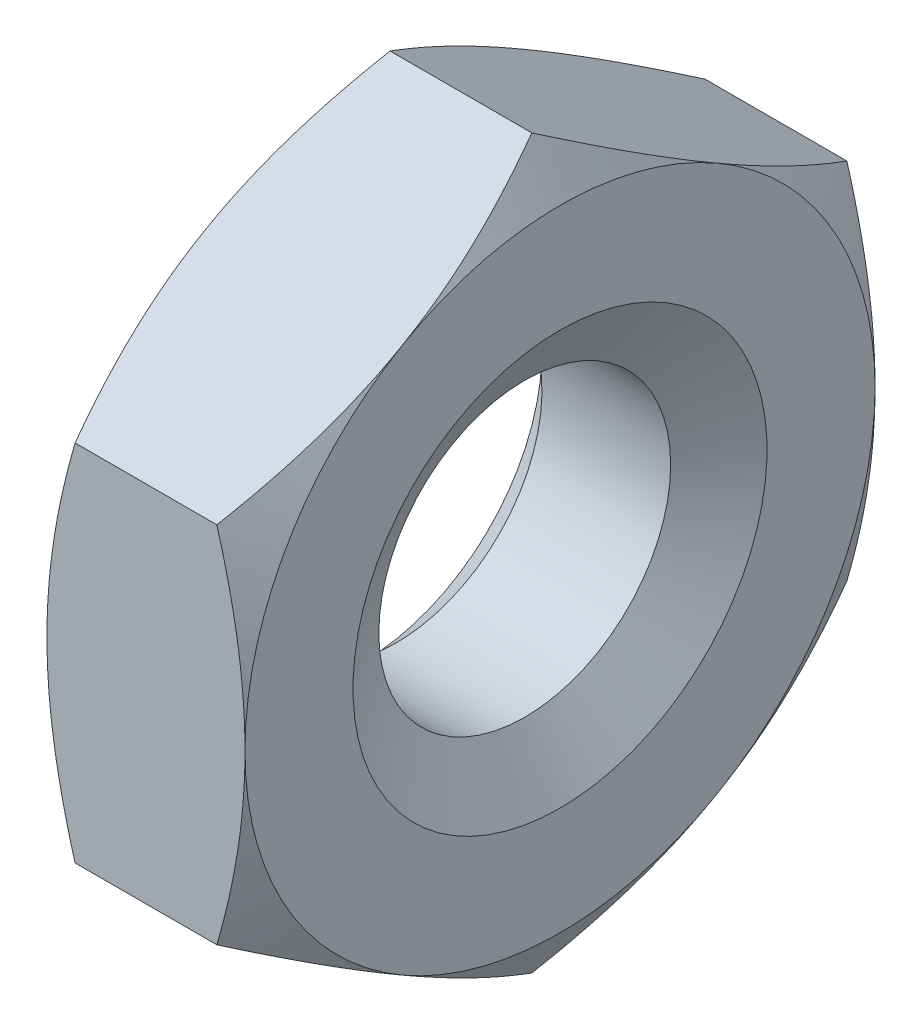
ISO-10303-21;
HEADER;
FILE_DESCRIPTION(('STEP AP214'),'2;1');
FILE_NAME('part.step','',(''),(''),'','','');
FILE_SCHEMA(('AUTOMOTIVE_DESIGN { 1 0 10303 214 1 1 1 1 }'));
ENDSEC;
DATA;
#1=APPLICATION_CONTEXT('core data for automotive mechanical design processes');
#2=APPLICATION_PROTOCOL_DEFINITION('international standard','automotive_design',2000,#1);
#3=PRODUCT_CONTEXT('',#1,'mechanical');
#4=PRODUCT('Part','Part','',(#3));
#5=PRODUCT_RELATED_PRODUCT_CATEGORY('part','',(#4));
#6=PRODUCT_DEFINITION_FORMATION('','',#4);
#7=PRODUCT_DEFINITION_CONTEXT('part definition',#1,'design');
#8=PRODUCT_DEFINITION('design','',#6,#7);
#9=PRODUCT_DEFINITION_SHAPE('','',#8);
#10=(LENGTH_UNIT() NAMED_UNIT(*) SI_UNIT(.MILLI.,.METRE.));
#11=(NAMED_UNIT(*) PLANE_ANGLE_UNIT() SI_UNIT($,.RADIAN.));
#12=(NAMED_UNIT(*) SI_UNIT($,.STERADIAN.) SOLID_ANGLE_UNIT());
#13=UNCERTAINTY_MEASURE_WITH_UNIT(LENGTH_MEASURE(1.E-05),#10,'distance_accuracy_value','');
#14=(GEOMETRIC_REPRESENTATION_CONTEXT(3) GLOBAL_UNCERTAINTY_ASSIGNED_CONTEXT((#13)) GLOBAL_UNIT_ASSIGNED_CONTEXT((#10,
#11,#12)) REPRESENTATION_CONTEXT('',''));
#15=CARTESIAN_POINT('',(0.,0.,0.));
#16=DIRECTION('',(0.,0.,1.));
#17=DIRECTION('',(1.,0.,0.));
#18=AXIS2_PLACEMENT_3D('',#15,#16,#17);
#19=CARTESIAN_POINT('',(1.53604719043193,0.,0.));
#20=DIRECTION('',(1.,0.,0.));
#21=DIRECTION('',(0.,1.,0.));
#22=AXIS2_PLACEMENT_3D('',#19,#20,#21);
#23=CONICAL_SURFACE('',#22,1.15,1.0471975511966);
#24=CARTESIAN_POINT('',(1.8080513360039,0.,0.));
#25=DIRECTION('',(1.,0.,0.));
#26=DIRECTION('',(0.,1.,0.));
#27=AXIS2_PLACEMENT_3D('',#24,#25,#26);
#28=CIRCLE('',#27,1.621125);
#29=CARTESIAN_POINT('',(1.8080513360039,-1.621125,0.));
#30=VERTEX_POINT('',#29);
#31=EDGE_CURVE('E27',#30,#30,#28,.T.);
#32=ORIENTED_EDGE('',*,*,#31,.F.);
#33=EDGE_LOOP('',(#32));
#34=FACE_BOUND('',#33,.T.);
#35=CARTESIAN_POINT('',(2.2,0.,0.));
#36=DIRECTION('',(-1.,0.,0.));
#37=DIRECTION('',(0.,0.,-1.));
#38=AXIS2_PLACEMENT_3D('',#35,#36,#37);
#39=CIRCLE('',#38,2.3);
#40=CARTESIAN_POINT('',(2.2,2.3,0.));
#41=VERTEX_POINT('',#40);
#42=EDGE_CURVE('E178',#41,#41,#39,.T.);
#43=ORIENTED_EDGE('',*,*,#42,.F.);
#44=EDGE_LOOP('',(#43));
#45=FACE_BOUND('',#44,.T.);
#46=ADVANCED_FACE('F15',(#34,#45),#23,.F.);
#47=CARTESIAN_POINT('',(0.1894375,0.,0.));
#48=DIRECTION('',(-1.,0.,0.));
#49=DIRECTION('',(0.,1.,0.));
#50=AXIS2_PLACEMENT_3D('',#47,#48,#49);
#51=CONICAL_SURFACE('',#50,1.8105625,0.785398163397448);
#52=CARTESIAN_POINT('',(0.378875,0.,0.));
#53=DIRECTION('',(1.,0.,0.));
#54=DIRECTION('',(0.,1.,0.));
#55=AXIS2_PLACEMENT_3D('',#52,#53,#54);
#56=CIRCLE('',#55,1.621125);
#57=CARTESIAN_POINT('',(0.378875,1.621125,0.));
#58=VERTEX_POINT('',#57);
#59=EDGE_CURVE('E9',#58,#58,#56,.T.);
#60=ORIENTED_EDGE('',*,*,#59,.T.);
#61=EDGE_LOOP('',(#60));
#62=FACE_BOUND('',#61,.T.);
#63=CARTESIAN_POINT('',(0.,0.,0.));
#64=DIRECTION('',(1.,0.,0.));
#65=DIRECTION('',(0.,1.,0.));
#66=AXIS2_PLACEMENT_3D('',#63,#64,#65);
#67=CIRCLE('',#66,2.);
#68=CARTESIAN_POINT('',(0.,2.,0.));
#69=VERTEX_POINT('',#68);
#70=EDGE_CURVE('E167',#69,#69,#67,.T.);
#71=ORIENTED_EDGE('',*,*,#70,.F.);
#72=EDGE_LOOP('',(#71));
#73=FACE_BOUND('',#72,.T.);
#74=ADVANCED_FACE('F398',(#62,#73),#51,.F.);
#75=CARTESIAN_POINT('',(1.7894375,0.,0.));
#76=DIRECTION('',(-1.,0.,0.));
#77=DIRECTION('',(0.,1.,0.));
#78=AXIS2_PLACEMENT_3D('',#75,#76,#77);
#79=CYLINDRICAL_SURFACE('',#78,1.621125);
#80=ORIENTED_EDGE('',*,*,#31,.T.);
#81=EDGE_LOOP('',(#80));
#82=FACE_BOUND('',#81,.T.);
#83=ORIENTED_EDGE('',*,*,#59,.F.);
#84=EDGE_LOOP('',(#83));
#85=FACE_BOUND('',#84,.T.);
#86=ADVANCED_FACE('F389',(#82,#85),#79,.F.);
#87=CARTESIAN_POINT('',(0.156606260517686,0.,0.));
#88=DIRECTION('',(1.,0.,0.));
#89=DIRECTION('',(0.,-1.,0.));
#90=AXIS2_PLACEMENT_3D('',#87,#88,#89);
#91=CONICAL_SURFACE('',#90,3.77125,1.0471975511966);
#92=CARTESIAN_POINT('',(0.313212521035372,-2.02282135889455,3.5));
#93=CARTESIAN_POINT('',(0.,-0.938664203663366,3.5));
#94=CARTESIAN_POINT('',(0.,0.,3.5));
#95=CARTESIAN_POINT('',(0.,0.938664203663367,3.5));
#96=CARTESIAN_POINT('',(0.313212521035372,2.02282135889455,3.5));
#97=(BOUNDED_CURVE() B_SPLINE_CURVE(2,(#92,#93,#94,#95,#96),.UNSPECIFIED.,.F.,
.F.) B_SPLINE_CURVE_WITH_KNOTS((3,2,3),(0.,2.05216073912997,4.10432147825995),
.UNSPECIFIED.) CURVE() GEOMETRIC_REPRESENTATION_ITEM() RATIONAL_B_SPLINE_CURVE((1.,
1.03802697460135,1.,1.03802697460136,1.)) REPRESENTATION_ITEM(''));
#98=CARTESIAN_POINT('',(0.312607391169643,-2.02072594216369,3.5));
#99=VERTEX_POINT('',#98);
#100=CARTESIAN_POINT('',(0.,0.,3.5));
#101=VERTEX_POINT('',#100);
#102=EDGE_CURVE('E242',#99,#101,#97,.T.);
#103=ORIENTED_EDGE('',*,*,#102,.T.);
#104=CARTESIAN_POINT('',(0.,0.,0.));
#105=DIRECTION('',(1.,0.,0.));
#106=DIRECTION('',(0.,-1.,0.));
#107=AXIS2_PLACEMENT_3D('',#104,#105,#106);
#108=CIRCLE('',#107,3.5);
#109=CARTESIAN_POINT('',(0.,-3.03108891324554,1.75));
#110=VERTEX_POINT('',#109);
#111=EDGE_CURVE('E223',#101,#110,#108,.T.);
#112=ORIENTED_EDGE('',*,*,#111,.T.);
#113=CARTESIAN_POINT('',(0.313212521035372,-4.04249959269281,-0.00181468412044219));
#114=CARTESIAN_POINT('',(0.,-3.50042101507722,0.937092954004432));
#115=CARTESIAN_POINT('',(0.,-3.03108891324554,1.75));
#116=CARTESIAN_POINT('',(0.,-2.56175681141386,2.56290704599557));
#117=CARTESIAN_POINT('',(0.313212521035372,-2.01967823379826,3.50181468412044));
#118=(BOUNDED_CURVE() B_SPLINE_CURVE(2,(#113,#114,#115,#116,#117),.UNSPECIFIED.,.F.,
.F.) B_SPLINE_CURVE_WITH_KNOTS((3,2,3),(0.,2.05216073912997,4.10432147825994),
.UNSPECIFIED.) CURVE() GEOMETRIC_REPRESENTATION_ITEM() RATIONAL_B_SPLINE_CURVE((1.,
1.03802697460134,1.,1.03802697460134,1.)) REPRESENTATION_ITEM(''));
#119=EDGE_CURVE('E119',#110,#99,#118,.T.);
#120=ORIENTED_EDGE('',*,*,#119,.T.);
#121=EDGE_LOOP('',(#103,#112,#120));
#122=FACE_BOUND('',#121,.T.);
#123=ADVANCED_FACE('F387',(#122),#91,.T.);
#124=CARTESIAN_POINT('',(0.156606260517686,0.,0.));
#125=DIRECTION('',(1.,0.,0.));
#126=DIRECTION('',(0.,-1.,0.));
#127=AXIS2_PLACEMENT_3D('',#124,#125,#126);
#128=CONICAL_SURFACE('',#127,3.77125,1.0471975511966);
#129=CARTESIAN_POINT('',(0.313212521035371,2.01967823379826,3.50181468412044));
#130=CARTESIAN_POINT('',(0.,2.56175681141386,2.56290704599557));
#131=CARTESIAN_POINT('',(0.,3.03108891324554,1.75));
#132=CARTESIAN_POINT('',(0.,3.50042101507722,0.937092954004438));
#133=CARTESIAN_POINT('',(0.313212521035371,4.04249959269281,-0.00181468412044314));
#134=(BOUNDED_CURVE() B_SPLINE_CURVE(2,(#129,#130,#131,#132,#133),.UNSPECIFIED.,.F.,
.F.) B_SPLINE_CURVE_WITH_KNOTS((3,2,3),(0.,2.05216073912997,4.10432147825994),
.UNSPECIFIED.) CURVE() GEOMETRIC_REPRESENTATION_ITEM() RATIONAL_B_SPLINE_CURVE((1.,
1.03802697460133,1.,1.03802697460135,1.)) REPRESENTATION_ITEM(''));
#135=CARTESIAN_POINT('',(0.312607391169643,2.02072594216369,3.5));
#136=VERTEX_POINT('',#135);
#137=CARTESIAN_POINT('',(0.,3.03108891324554,1.75));
#138=VERTEX_POINT('',#137);
#139=EDGE_CURVE('E224',#136,#138,#134,.T.);
#140=ORIENTED_EDGE('',*,*,#139,.T.);
#141=CARTESIAN_POINT('',(0.,0.,0.));
#142=DIRECTION('',(1.,0.,0.));
#143=DIRECTION('',(0.,-1.,0.));
#144=AXIS2_PLACEMENT_3D('',#141,#142,#143);
#145=CIRCLE('',#144,3.5);
#146=EDGE_CURVE('E186',#138,#101,#145,.T.);
#147=ORIENTED_EDGE('',*,*,#146,.T.);
#148=CARTESIAN_POINT('',(0.313212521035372,-2.02282135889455,3.5));
#149=CARTESIAN_POINT('',(0.,-0.938664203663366,3.5));
#150=CARTESIAN_POINT('',(0.,0.,3.5));
#151=CARTESIAN_POINT('',(0.,0.938664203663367,3.5));
#152=CARTESIAN_POINT('',(0.313212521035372,2.02282135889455,3.5));
#153=(BOUNDED_CURVE() B_SPLINE_CURVE(2,(#148,#149,#150,#151,#152),.UNSPECIFIED.,.F.,
.F.) B_SPLINE_CURVE_WITH_KNOTS((3,2,3),(0.,2.05216073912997,4.10432147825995),
.UNSPECIFIED.) CURVE() GEOMETRIC_REPRESENTATION_ITEM() RATIONAL_B_SPLINE_CURVE((1.,
1.03802697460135,1.,1.03802697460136,1.)) REPRESENTATION_ITEM(''));
#154=EDGE_CURVE('E182',#101,#136,#153,.T.);
#155=ORIENTED_EDGE('',*,*,#154,.T.);
#156=EDGE_LOOP('',(#140,#147,#155));
#157=FACE_BOUND('',#156,.T.);
#158=ADVANCED_FACE('F380',(#157),#128,.T.);
#159=CARTESIAN_POINT('',(0.156606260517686,0.,0.));
#160=DIRECTION('',(1.,0.,0.));
#161=DIRECTION('',(0.,-1.,0.));
#162=AXIS2_PLACEMENT_3D('',#159,#160,#161);
#163=CONICAL_SURFACE('',#162,3.77125,1.0471975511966);
#164=CARTESIAN_POINT('',(0.313212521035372,4.04249959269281,0.00181468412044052));
#165=CARTESIAN_POINT('',(0.,3.50042101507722,-0.937092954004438));
#166=CARTESIAN_POINT('',(0.,3.03108891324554,-1.75));
#167=CARTESIAN_POINT('',(0.,2.56175681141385,-2.56290704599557));
#168=CARTESIAN_POINT('',(0.313212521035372,2.01967823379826,-3.50181468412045));
#169=(BOUNDED_CURVE() B_SPLINE_CURVE(2,(#164,#165,#166,#167,#168),.UNSPECIFIED.,.F.,
.F.) B_SPLINE_CURVE_WITH_KNOTS((3,2,3),(0.,2.05216073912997,4.10432147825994),
.UNSPECIFIED.) CURVE() GEOMETRIC_REPRESENTATION_ITEM() RATIONAL_B_SPLINE_CURVE((1.,
1.03802697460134,1.,1.03802697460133,1.)) REPRESENTATION_ITEM(''));
#170=CARTESIAN_POINT('',(0.312607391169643,4.04145188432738,0.));
#171=VERTEX_POINT('',#170);
#172=CARTESIAN_POINT('',(0.,3.03108891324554,-1.75));
#173=VERTEX_POINT('',#172);
#174=EDGE_CURVE('E174',#171,#173,#169,.T.);
#175=ORIENTED_EDGE('',*,*,#174,.T.);
#176=CARTESIAN_POINT('',(0.,0.,0.));
#177=DIRECTION('',(1.,0.,0.));
#178=DIRECTION('',(0.,-1.,0.));
#179=AXIS2_PLACEMENT_3D('',#176,#177,#178);
#180=CIRCLE('',#179,3.5);
#181=EDGE_CURVE('E187',#173,#138,#180,.T.);
#182=ORIENTED_EDGE('',*,*,#181,.T.);
#183=CARTESIAN_POINT('',(0.313212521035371,2.01967823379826,3.50181468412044));
#184=CARTESIAN_POINT('',(0.,2.56175681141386,2.56290704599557));
#185=CARTESIAN_POINT('',(0.,3.03108891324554,1.75));
#186=CARTESIAN_POINT('',(0.,3.50042101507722,0.937092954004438));
#187=CARTESIAN_POINT('',(0.313212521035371,4.04249959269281,-0.00181468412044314));
#188=(BOUNDED_CURVE() B_SPLINE_CURVE(2,(#183,#184,#185,#186,#187),.UNSPECIFIED.,.F.,
.F.) B_SPLINE_CURVE_WITH_KNOTS((3,2,3),(0.,2.05216073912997,4.10432147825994),
.UNSPECIFIED.) CURVE() GEOMETRIC_REPRESENTATION_ITEM() RATIONAL_B_SPLINE_CURVE((1.,
1.03802697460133,1.,1.03802697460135,1.)) REPRESENTATION_ITEM(''));
#189=EDGE_CURVE('E96',#138,#171,#188,.T.);
#190=ORIENTED_EDGE('',*,*,#189,.T.);
#191=EDGE_LOOP('',(#175,#182,#190));
#192=FACE_BOUND('',#191,.T.);
#193=ADVANCED_FACE('F396',(#192),#163,.T.);
#194=CARTESIAN_POINT('',(0.156606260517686,0.,0.));
#195=DIRECTION('',(1.,0.,0.));
#196=DIRECTION('',(0.,-1.,0.));
#197=AXIS2_PLACEMENT_3D('',#194,#195,#196);
#198=CONICAL_SURFACE('',#197,3.77125,1.0471975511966);
#199=CARTESIAN_POINT('',(0.313212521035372,4.04249959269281,0.00181468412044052));
#200=CARTESIAN_POINT('',(0.,3.50042101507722,-0.937092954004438));
#201=CARTESIAN_POINT('',(0.,3.03108891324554,-1.75));
#202=CARTESIAN_POINT('',(0.,2.56175681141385,-2.56290704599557));
#203=CARTESIAN_POINT('',(0.313212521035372,2.01967823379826,-3.50181468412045));
#204=(BOUNDED_CURVE() B_SPLINE_CURVE(2,(#199,#200,#201,#202,#203),.UNSPECIFIED.,.F.,
.F.) B_SPLINE_CURVE_WITH_KNOTS((3,2,3),(0.,2.05216073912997,4.10432147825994),
.UNSPECIFIED.) CURVE() GEOMETRIC_REPRESENTATION_ITEM() RATIONAL_B_SPLINE_CURVE((1.,
1.03802697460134,1.,1.03802697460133,1.)) REPRESENTATION_ITEM(''));
#205=CARTESIAN_POINT('',(0.312607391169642,2.02072594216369,-3.5));
#206=VERTEX_POINT('',#205);
#207=EDGE_CURVE('E89',#173,#206,#204,.T.);
#208=ORIENTED_EDGE('',*,*,#207,.T.);
#209=CARTESIAN_POINT('',(0.313212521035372,2.02282135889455,-3.5));
#210=CARTESIAN_POINT('',(0.,0.938664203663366,-3.5));
#211=CARTESIAN_POINT('',(0.,0.,-3.5));
#212=CARTESIAN_POINT('',(0.,-0.938664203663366,-3.5));
#213=CARTESIAN_POINT('',(0.313212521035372,-2.02282135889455,-3.5));
#214=(BOUNDED_CURVE() B_SPLINE_CURVE(2,(#209,#210,#211,#212,#213),.UNSPECIFIED.,.F.,
.F.) B_SPLINE_CURVE_WITH_KNOTS((3,2,3),(0.,2.05216073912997,4.10432147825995),
.UNSPECIFIED.) CURVE() GEOMETRIC_REPRESENTATION_ITEM() RATIONAL_B_SPLINE_CURVE((1.,
1.03802697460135,1.,1.03802697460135,1.)) REPRESENTATION_ITEM(''));
#215=CARTESIAN_POINT('',(0.,0.,-3.5));
#216=VERTEX_POINT('',#215);
#217=EDGE_CURVE('E230',#206,#216,#214,.T.);
#218=ORIENTED_EDGE('',*,*,#217,.T.);
#219=CARTESIAN_POINT('',(0.,0.,0.));
#220=DIRECTION('',(1.,0.,0.));
#221=DIRECTION('',(0.,-1.,0.));
#222=AXIS2_PLACEMENT_3D('',#219,#220,#221);
#223=CIRCLE('',#222,3.5);
#224=EDGE_CURVE('E208',#216,#173,#223,.T.);
#225=ORIENTED_EDGE('',*,*,#224,.T.);
#226=EDGE_LOOP('',(#208,#218,#225));
#227=FACE_BOUND('',#226,.T.);
#228=ADVANCED_FACE('F441',(#227),#198,.T.);
#229=CARTESIAN_POINT('',(0.156606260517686,0.,0.));
#230=DIRECTION('',(1.,0.,0.));
#231=DIRECTION('',(0.,-1.,0.));
#232=AXIS2_PLACEMENT_3D('',#229,#230,#231);
#233=CONICAL_SURFACE('',#232,3.77125,1.0471975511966);
#234=CARTESIAN_POINT('',(0.313212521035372,2.02282135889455,-3.5));
#235=CARTESIAN_POINT('',(0.,0.938664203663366,-3.5));
#236=CARTESIAN_POINT('',(0.,0.,-3.5));
#237=CARTESIAN_POINT('',(0.,-0.938664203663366,-3.5));
#238=CARTESIAN_POINT('',(0.313212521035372,-2.02282135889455,-3.5));
#239=(BOUNDED_CURVE() B_SPLINE_CURVE(2,(#234,#235,#236,#237,#238),.UNSPECIFIED.,.F.,
.F.) B_SPLINE_CURVE_WITH_KNOTS((3,2,3),(0.,2.05216073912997,4.10432147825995),
.UNSPECIFIED.) CURVE() GEOMETRIC_REPRESENTATION_ITEM() RATIONAL_B_SPLINE_CURVE((1.,
1.03802697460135,1.,1.03802697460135,1.)) REPRESENTATION_ITEM(''));
#240=CARTESIAN_POINT('',(0.312607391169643,-2.02072594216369,-3.5));
#241=VERTEX_POINT('',#240);
#242=EDGE_CURVE('E200',#216,#241,#239,.T.);
#243=ORIENTED_EDGE('',*,*,#242,.T.);
#244=CARTESIAN_POINT('',(0.313212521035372,-2.01967823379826,-3.50181468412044));
#245=CARTESIAN_POINT('',(0.,-2.56175681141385,-2.56290704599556));
#246=CARTESIAN_POINT('',(0.,-3.03108891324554,-1.75));
#247=CARTESIAN_POINT('',(0.,-3.50042101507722,-0.937092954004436));
#248=CARTESIAN_POINT('',(0.313212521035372,-4.04249959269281,0.00181468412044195));
#249=(BOUNDED_CURVE() B_SPLINE_CURVE(2,(#244,#245,#246,#247,#248),.UNSPECIFIED.,.F.,
.F.) B_SPLINE_CURVE_WITH_KNOTS((3,2,3),(0.,2.05216073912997,4.10432147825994),
.UNSPECIFIED.) CURVE() GEOMETRIC_REPRESENTATION_ITEM() RATIONAL_B_SPLINE_CURVE((1.,
1.03802697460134,1.,1.03802697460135,1.)) REPRESENTATION_ITEM(''));
#250=CARTESIAN_POINT('',(0.,-3.03108891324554,-1.75));
#251=VERTEX_POINT('',#250);
#252=EDGE_CURVE('E209',#241,#251,#249,.T.);
#253=ORIENTED_EDGE('',*,*,#252,.T.);
#254=CARTESIAN_POINT('',(0.,0.,0.));
#255=DIRECTION('',(1.,0.,0.));
#256=DIRECTION('',(0.,-1.,0.));
#257=AXIS2_PLACEMENT_3D('',#254,#255,#256);
#258=CIRCLE('',#257,3.5);
#259=EDGE_CURVE('E235',#251,#216,#258,.T.);
#260=ORIENTED_EDGE('',*,*,#259,.T.);
#261=EDGE_LOOP('',(#243,#253,#260));
#262=FACE_BOUND('',#261,.T.);
#263=ADVANCED_FACE('F412',(#262),#233,.T.);
#264=CARTESIAN_POINT('',(0.156606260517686,0.,0.));
#265=DIRECTION('',(1.,0.,0.));
#266=DIRECTION('',(0.,-1.,0.));
#267=AXIS2_PLACEMENT_3D('',#264,#265,#266);
#268=CONICAL_SURFACE('',#267,3.77125,1.0471975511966);
#269=CARTESIAN_POINT('',(0.313212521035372,-2.01967823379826,-3.50181468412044));
#270=CARTESIAN_POINT('',(0.,-2.56175681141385,-2.56290704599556));
#271=CARTESIAN_POINT('',(0.,-3.03108891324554,-1.75));
#272=CARTESIAN_POINT('',(0.,-3.50042101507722,-0.937092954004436));
#273=CARTESIAN_POINT('',(0.313212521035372,-4.04249959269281,0.00181468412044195));
#274=(BOUNDED_CURVE() B_SPLINE_CURVE(2,(#269,#270,#271,#272,#273),.UNSPECIFIED.,.F.,
.F.) B_SPLINE_CURVE_WITH_KNOTS((3,2,3),(0.,2.05216073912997,4.10432147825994),
.UNSPECIFIED.) CURVE() GEOMETRIC_REPRESENTATION_ITEM() RATIONAL_B_SPLINE_CURVE((1.,
1.03802697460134,1.,1.03802697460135,1.)) REPRESENTATION_ITEM(''));
#275=CARTESIAN_POINT('',(0.312607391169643,-4.04145188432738,0.));
#276=VERTEX_POINT('',#275);
#277=EDGE_CURVE('E231',#251,#276,#274,.T.);
#278=ORIENTED_EDGE('',*,*,#277,.T.);
#279=CARTESIAN_POINT('',(0.313212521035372,-4.04249959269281,-0.00181468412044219));
#280=CARTESIAN_POINT('',(0.,-3.50042101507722,0.937092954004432));
#281=CARTESIAN_POINT('',(0.,-3.03108891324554,1.75));
#282=CARTESIAN_POINT('',(0.,-2.56175681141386,2.56290704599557));
#283=CARTESIAN_POINT('',(0.313212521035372,-2.01967823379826,3.50181468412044));
#284=(BOUNDED_CURVE() B_SPLINE_CURVE(2,(#279,#280,#281,#282,#283),.UNSPECIFIED.,.F.,
.F.) B_SPLINE_CURVE_WITH_KNOTS((3,2,3),(0.,2.05216073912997,4.10432147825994),
.UNSPECIFIED.) CURVE() GEOMETRIC_REPRESENTATION_ITEM() RATIONAL_B_SPLINE_CURVE((1.,
1.03802697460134,1.,1.03802697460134,1.)) REPRESENTATION_ITEM(''));
#285=EDGE_CURVE('E111',#276,#110,#284,.T.);
#286=ORIENTED_EDGE('',*,*,#285,.T.);
#287=CARTESIAN_POINT('',(0.,0.,0.));
#288=DIRECTION('',(1.,0.,0.));
#289=DIRECTION('',(0.,-1.,0.));
#290=AXIS2_PLACEMENT_3D('',#287,#288,#289);
#291=CIRCLE('',#290,3.5);
#292=EDGE_CURVE('E313',#110,#251,#291,.T.);
#293=ORIENTED_EDGE('',*,*,#292,.T.);
#294=EDGE_LOOP('',(#278,#286,#293));
#295=FACE_BOUND('',#294,.T.);
#296=ADVANCED_FACE('F414',(#295),#268,.T.);
#297=CARTESIAN_POINT('',(2.04339373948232,0.,0.));
#298=DIRECTION('',(-1.,0.,0.));
#299=DIRECTION('',(0.,-1.,0.));
#300=AXIS2_PLACEMENT_3D('',#297,#298,#299);
#301=CONICAL_SURFACE('',#300,3.77125,1.0471975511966);
#302=CARTESIAN_POINT('',(1.88678747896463,2.01967823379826,-3.50181468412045));
#303=CARTESIAN_POINT('',(2.2,2.56175681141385,-2.56290704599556));
#304=CARTESIAN_POINT('',(2.2,3.03108891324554,-1.75));
#305=CARTESIAN_POINT('',(2.2,3.50042101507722,-0.937092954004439));
#306=CARTESIAN_POINT('',(1.88678747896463,4.04249959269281,0.00181468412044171));
#307=(BOUNDED_CURVE() B_SPLINE_CURVE(2,(#302,#303,#304,#305,#306),.UNSPECIFIED.,.F.,
.F.) B_SPLINE_CURVE_WITH_KNOTS((3,2,3),(0.,2.05216073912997,4.10432147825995),
.UNSPECIFIED.) CURVE() GEOMETRIC_REPRESENTATION_ITEM() RATIONAL_B_SPLINE_CURVE((1.,
1.03802697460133,1.,1.03802697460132,1.)) REPRESENTATION_ITEM(''));
#308=CARTESIAN_POINT('',(1.88739260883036,2.02072594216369,-3.5));
#309=VERTEX_POINT('',#308);
#310=CARTESIAN_POINT('',(2.2,3.03108891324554,-1.75));
#311=VERTEX_POINT('',#310);
#312=EDGE_CURVE('E312',#309,#311,#307,.T.);
#313=ORIENTED_EDGE('',*,*,#312,.T.);
#314=CARTESIAN_POINT('',(2.2,0.,0.));
#315=DIRECTION('',(1.,0.,0.));
#316=DIRECTION('',(0.,-1.,0.));
#317=AXIS2_PLACEMENT_3D('',#314,#315,#316);
#318=CIRCLE('',#317,3.5);
#319=CARTESIAN_POINT('',(2.2,0.,-3.5));
#320=VERTEX_POINT('',#319);
#321=EDGE_CURVE('E240',#320,#311,#318,.T.);
#322=ORIENTED_EDGE('',*,*,#321,.F.);
#323=CARTESIAN_POINT('',(1.88678747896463,-2.02282135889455,-3.5));
#324=CARTESIAN_POINT('',(2.2,-0.938664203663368,-3.5));
#325=CARTESIAN_POINT('',(2.2,0.,-3.5));
#326=CARTESIAN_POINT('',(2.2,0.938664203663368,-3.5));
#327=CARTESIAN_POINT('',(1.88678747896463,2.02282135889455,-3.5));
#328=(BOUNDED_CURVE() B_SPLINE_CURVE(2,(#323,#324,#325,#326,#327),.UNSPECIFIED.,.F.,
.F.) B_SPLINE_CURVE_WITH_KNOTS((3,2,3),(0.,2.05216073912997,4.10432147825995),
.UNSPECIFIED.) CURVE() GEOMETRIC_REPRESENTATION_ITEM() RATIONAL_B_SPLINE_CURVE((1.,
1.03802697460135,1.,1.03802697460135,1.)) REPRESENTATION_ITEM(''));
#329=EDGE_CURVE('E308',#320,#309,#328,.T.);
#330=ORIENTED_EDGE('',*,*,#329,.T.);
#331=EDGE_LOOP('',(#313,#322,#330));
#332=FACE_BOUND('',#331,.T.);
#333=ADVANCED_FACE('F17',(#332),#301,.T.);
#334=CARTESIAN_POINT('',(2.04339373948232,0.,0.));
#335=DIRECTION('',(-1.,0.,0.));
#336=DIRECTION('',(0.,-1.,0.));
#337=AXIS2_PLACEMENT_3D('',#334,#335,#336);
#338=CONICAL_SURFACE('',#337,3.77125,1.0471975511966);
#339=CARTESIAN_POINT('',(1.88678747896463,4.04249959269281,-0.0018146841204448));
#340=CARTESIAN_POINT('',(2.2,3.50042101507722,0.937092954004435));
#341=CARTESIAN_POINT('',(2.2,3.03108891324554,1.75));
#342=CARTESIAN_POINT('',(2.2,2.56175681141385,2.56290704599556));
#343=CARTESIAN_POINT('',(1.88678747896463,2.01967823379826,3.50181468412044));
#344=(BOUNDED_CURVE() B_SPLINE_CURVE(2,(#339,#340,#341,#342,#343),.UNSPECIFIED.,.F.,
.F.) B_SPLINE_CURVE_WITH_KNOTS((3,2,3),(0.,2.05216073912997,4.10432147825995),
.UNSPECIFIED.) CURVE() GEOMETRIC_REPRESENTATION_ITEM() RATIONAL_B_SPLINE_CURVE((1.,
1.03802697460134,1.,1.03802697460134,1.)) REPRESENTATION_ITEM(''));
#345=CARTESIAN_POINT('',(1.88739260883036,4.04145188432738,0.));
#346=VERTEX_POINT('',#345);
#347=CARTESIAN_POINT('',(2.2,3.03108891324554,1.75));
#348=VERTEX_POINT('',#347);
#349=EDGE_CURVE('E216',#346,#348,#344,.T.);
#350=ORIENTED_EDGE('',*,*,#349,.T.);
#351=CARTESIAN_POINT('',(2.2,0.,0.));
#352=DIRECTION('',(1.,0.,0.));
#353=DIRECTION('',(0.,-1.,0.));
#354=AXIS2_PLACEMENT_3D('',#351,#352,#353);
#355=CIRCLE('',#354,3.5);
#356=EDGE_CURVE('E144',#311,#348,#355,.T.);
#357=ORIENTED_EDGE('',*,*,#356,.F.);
#358=CARTESIAN_POINT('',(1.88678747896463,2.01967823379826,-3.50181468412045));
#359=CARTESIAN_POINT('',(2.2,2.56175681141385,-2.56290704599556));
#360=CARTESIAN_POINT('',(2.2,3.03108891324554,-1.75));
#361=CARTESIAN_POINT('',(2.2,3.50042101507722,-0.937092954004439));
#362=CARTESIAN_POINT('',(1.88678747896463,4.04249959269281,0.00181468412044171));
#363=(BOUNDED_CURVE() B_SPLINE_CURVE(2,(#358,#359,#360,#361,#362),.UNSPECIFIED.,.F.,
.F.) B_SPLINE_CURVE_WITH_KNOTS((3,2,3),(0.,2.05216073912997,4.10432147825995),
.UNSPECIFIED.) CURVE() GEOMETRIC_REPRESENTATION_ITEM() RATIONAL_B_SPLINE_CURVE((1.,
1.03802697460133,1.,1.03802697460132,1.)) REPRESENTATION_ITEM(''));
#364=EDGE_CURVE('E163',#311,#346,#363,.T.);
#365=ORIENTED_EDGE('',*,*,#364,.T.);
#366=EDGE_LOOP('',(#350,#357,#365));
#367=FACE_BOUND('',#366,.T.);
#368=ADVANCED_FACE('F375',(#367),#338,.T.);
#369=CARTESIAN_POINT('',(2.04339373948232,0.,0.));
#370=DIRECTION('',(-1.,0.,0.));
#371=DIRECTION('',(0.,-1.,0.));
#372=AXIS2_PLACEMENT_3D('',#369,#370,#371);
#373=CONICAL_SURFACE('',#372,3.77125,1.0471975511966);
#374=CARTESIAN_POINT('',(1.88678747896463,2.02282135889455,3.5));
#375=CARTESIAN_POINT('',(2.2,0.938664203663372,3.5));
#376=CARTESIAN_POINT('',(2.2,0.,3.5));
#377=CARTESIAN_POINT('',(2.2,-0.93866420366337,3.5));
#378=CARTESIAN_POINT('',(1.88678747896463,-2.02282135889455,3.5));
#379=(BOUNDED_CURVE() B_SPLINE_CURVE(2,(#374,#375,#376,#377,#378),.UNSPECIFIED.,.F.,
.F.) B_SPLINE_CURVE_WITH_KNOTS((3,2,3),(0.,2.05216073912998,4.10432147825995),
.UNSPECIFIED.) CURVE() GEOMETRIC_REPRESENTATION_ITEM() RATIONAL_B_SPLINE_CURVE((1.,
1.03802697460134,1.,1.03802697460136,1.)) REPRESENTATION_ITEM(''));
#380=CARTESIAN_POINT('',(1.88739260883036,2.02072594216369,3.5));
#381=VERTEX_POINT('',#380);
#382=CARTESIAN_POINT('',(2.2,0.,3.5));
#383=VERTEX_POINT('',#382);
#384=EDGE_CURVE('E154',#381,#383,#379,.T.);
#385=ORIENTED_EDGE('',*,*,#384,.T.);
#386=CARTESIAN_POINT('',(2.2,0.,0.));
#387=DIRECTION('',(1.,0.,0.));
#388=DIRECTION('',(0.,-1.,0.));
#389=AXIS2_PLACEMENT_3D('',#386,#387,#388);
#390=CIRCLE('',#389,3.5);
#391=EDGE_CURVE('E137',#348,#383,#390,.T.);
#392=ORIENTED_EDGE('',*,*,#391,.F.);
#393=CARTESIAN_POINT('',(1.88678747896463,4.04249959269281,-0.0018146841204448));
#394=CARTESIAN_POINT('',(2.2,3.50042101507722,0.937092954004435));
#395=CARTESIAN_POINT('',(2.2,3.03108891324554,1.75));
#396=CARTESIAN_POINT('',(2.2,2.56175681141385,2.56290704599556));
#397=CARTESIAN_POINT('',(1.88678747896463,2.01967823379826,3.50181468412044));
#398=(BOUNDED_CURVE() B_SPLINE_CURVE(2,(#393,#394,#395,#396,#397),.UNSPECIFIED.,.F.,
.F.) B_SPLINE_CURVE_WITH_KNOTS((3,2,3),(0.,2.05216073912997,4.10432147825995),
.UNSPECIFIED.) CURVE() GEOMETRIC_REPRESENTATION_ITEM() RATIONAL_B_SPLINE_CURVE((1.,
1.03802697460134,1.,1.03802697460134,1.)) REPRESENTATION_ITEM(''));
#399=EDGE_CURVE('E132',#348,#381,#398,.T.);
#400=ORIENTED_EDGE('',*,*,#399,.T.);
#401=EDGE_LOOP('',(#385,#392,#400));
#402=FACE_BOUND('',#401,.T.);
#403=ADVANCED_FACE('F162',(#402),#373,.T.);
#404=CARTESIAN_POINT('',(2.04339373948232,0.,0.));
#405=DIRECTION('',(-1.,0.,0.));
#406=DIRECTION('',(0.,-1.,0.));
#407=AXIS2_PLACEMENT_3D('',#404,#405,#406);
#408=CONICAL_SURFACE('',#407,3.77125,1.0471975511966);
#409=CARTESIAN_POINT('',(1.88678747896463,2.02282135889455,3.5));
#410=CARTESIAN_POINT('',(2.2,0.938664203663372,3.5));
#411=CARTESIAN_POINT('',(2.2,0.,3.5));
#412=CARTESIAN_POINT('',(2.2,-0.93866420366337,3.5));
#413=CARTESIAN_POINT('',(1.88678747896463,-2.02282135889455,3.5));
#414=(BOUNDED_CURVE() B_SPLINE_CURVE(2,(#409,#410,#411,#412,#413),.UNSPECIFIED.,.F.,
.F.) B_SPLINE_CURVE_WITH_KNOTS((3,2,3),(0.,2.05216073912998,4.10432147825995),
.UNSPECIFIED.) CURVE() GEOMETRIC_REPRESENTATION_ITEM() RATIONAL_B_SPLINE_CURVE((1.,
1.03802697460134,1.,1.03802697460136,1.)) REPRESENTATION_ITEM(''));
#415=CARTESIAN_POINT('',(1.88739260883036,-2.02072594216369,3.5));
#416=VERTEX_POINT('',#415);
#417=EDGE_CURVE('E150',#383,#416,#414,.T.);
#418=ORIENTED_EDGE('',*,*,#417,.T.);
#419=CARTESIAN_POINT('',(1.88678747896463,-2.01967823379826,3.50181468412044));
#420=CARTESIAN_POINT('',(2.2,-2.56175681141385,2.56290704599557));
#421=CARTESIAN_POINT('',(2.2,-3.03108891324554,1.75));
#422=CARTESIAN_POINT('',(2.2,-3.50042101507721,0.937092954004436));
#423=CARTESIAN_POINT('',(1.88678747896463,-4.04249959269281,-0.00181468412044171));
#424=(BOUNDED_CURVE() B_SPLINE_CURVE(2,(#419,#420,#421,#422,#423),.UNSPECIFIED.,.F.,
.F.) B_SPLINE_CURVE_WITH_KNOTS((3,2,3),(0.,2.05216073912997,4.10432147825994),
.UNSPECIFIED.) CURVE() GEOMETRIC_REPRESENTATION_ITEM() RATIONAL_B_SPLINE_CURVE((1.,
1.03802697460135,1.,1.03802697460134,1.)) REPRESENTATION_ITEM(''));
#425=CARTESIAN_POINT('',(2.2,-3.03108891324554,1.75));
#426=VERTEX_POINT('',#425);
#427=EDGE_CURVE('E160',#416,#426,#424,.T.);
#428=ORIENTED_EDGE('',*,*,#427,.T.);
#429=CARTESIAN_POINT('',(2.2,0.,0.));
#430=DIRECTION('',(1.,0.,0.));
#431=DIRECTION('',(0.,-1.,0.));
#432=AXIS2_PLACEMENT_3D('',#429,#430,#431);
#433=CIRCLE('',#432,3.5);
#434=EDGE_CURVE('E141',#383,#426,#433,.T.);
#435=ORIENTED_EDGE('',*,*,#434,.F.);
#436=EDGE_LOOP('',(#418,#428,#435));
#437=FACE_BOUND('',#436,.T.);
#438=ADVANCED_FACE('F165',(#437),#408,.T.);
#439=CARTESIAN_POINT('',(2.04339373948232,0.,0.));
#440=DIRECTION('',(-1.,0.,0.));
#441=DIRECTION('',(0.,-1.,0.));
#442=AXIS2_PLACEMENT_3D('',#439,#440,#441);
#443=CONICAL_SURFACE('',#442,3.77125,1.0471975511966);
#444=CARTESIAN_POINT('',(1.88678747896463,-2.01967823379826,3.50181468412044));
#445=CARTESIAN_POINT('',(2.2,-2.56175681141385,2.56290704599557));
#446=CARTESIAN_POINT('',(2.2,-3.03108891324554,1.75));
#447=CARTESIAN_POINT('',(2.2,-3.50042101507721,0.937092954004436));
#448=CARTESIAN_POINT('',(1.88678747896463,-4.04249959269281,-0.00181468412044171));
#449=(BOUNDED_CURVE() B_SPLINE_CURVE(2,(#444,#445,#446,#447,#448),.UNSPECIFIED.,.F.,
.F.) B_SPLINE_CURVE_WITH_KNOTS((3,2,3),(0.,2.05216073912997,4.10432147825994),
.UNSPECIFIED.) CURVE() GEOMETRIC_REPRESENTATION_ITEM() RATIONAL_B_SPLINE_CURVE((1.,
1.03802697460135,1.,1.03802697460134,1.)) REPRESENTATION_ITEM(''));
#450=CARTESIAN_POINT('',(1.88739260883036,-4.04145188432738,0.));
#451=VERTEX_POINT('',#450);
#452=EDGE_CURVE('E303',#426,#451,#449,.T.);
#453=ORIENTED_EDGE('',*,*,#452,.T.);
#454=CARTESIAN_POINT('',(1.88678747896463,-4.04249959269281,0.00181468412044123));
#455=CARTESIAN_POINT('',(2.2,-3.50042101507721,-0.937092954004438));
#456=CARTESIAN_POINT('',(2.2,-3.03108891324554,-1.75));
#457=CARTESIAN_POINT('',(2.2,-2.56175681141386,-2.56290704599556));
#458=CARTESIAN_POINT('',(1.88678747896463,-2.01967823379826,-3.50181468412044));
#459=(BOUNDED_CURVE() B_SPLINE_CURVE(2,(#454,#455,#456,#457,#458),.UNSPECIFIED.,.F.,
.F.) B_SPLINE_CURVE_WITH_KNOTS((3,2,3),(0.,2.05216073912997,4.10432147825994),
.UNSPECIFIED.) CURVE() GEOMETRIC_REPRESENTATION_ITEM() RATIONAL_B_SPLINE_CURVE((1.,
1.03802697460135,1.,1.03802697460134,1.)) REPRESENTATION_ITEM(''));
#460=CARTESIAN_POINT('',(2.2,-3.03108891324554,-1.75));
#461=VERTEX_POINT('',#460);
#462=EDGE_CURVE('E248',#451,#461,#459,.T.);
#463=ORIENTED_EDGE('',*,*,#462,.T.);
#464=CARTESIAN_POINT('',(2.2,0.,0.));
#465=DIRECTION('',(1.,0.,0.));
#466=DIRECTION('',(0.,-1.,0.));
#467=AXIS2_PLACEMENT_3D('',#464,#465,#466);
#468=CIRCLE('',#467,3.5);
#469=EDGE_CURVE('E181',#426,#461,#468,.T.);
#470=ORIENTED_EDGE('',*,*,#469,.F.);
#471=EDGE_LOOP('',(#453,#463,#470));
#472=FACE_BOUND('',#471,.T.);
#473=ADVANCED_FACE('F417',(#472),#443,.T.);
#474=CARTESIAN_POINT('',(2.04339373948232,0.,0.));
#475=DIRECTION('',(-1.,0.,0.));
#476=DIRECTION('',(0.,-1.,0.));
#477=AXIS2_PLACEMENT_3D('',#474,#475,#476);
#478=CONICAL_SURFACE('',#477,3.77125,1.0471975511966);
#479=CARTESIAN_POINT('',(1.88678747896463,-4.04249959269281,0.00181468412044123));
#480=CARTESIAN_POINT('',(2.2,-3.50042101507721,-0.937092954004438));
#481=CARTESIAN_POINT('',(2.2,-3.03108891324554,-1.75));
#482=CARTESIAN_POINT('',(2.2,-2.56175681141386,-2.56290704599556));
#483=CARTESIAN_POINT('',(1.88678747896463,-2.01967823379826,-3.50181468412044));
#484=(BOUNDED_CURVE() B_SPLINE_CURVE(2,(#479,#480,#481,#482,#483),.UNSPECIFIED.,.F.,
.F.) B_SPLINE_CURVE_WITH_KNOTS((3,2,3),(0.,2.05216073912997,4.10432147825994),
.UNSPECIFIED.) CURVE() GEOMETRIC_REPRESENTATION_ITEM() RATIONAL_B_SPLINE_CURVE((1.,
1.03802697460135,1.,1.03802697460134,1.)) REPRESENTATION_ITEM(''));
#485=CARTESIAN_POINT('',(1.88739260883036,-2.02072594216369,-3.5));
#486=VERTEX_POINT('',#485);
#487=EDGE_CURVE('E243',#461,#486,#484,.T.);
#488=ORIENTED_EDGE('',*,*,#487,.T.);
#489=CARTESIAN_POINT('',(1.88678747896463,-2.02282135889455,-3.5));
#490=CARTESIAN_POINT('',(2.2,-0.938664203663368,-3.5));
#491=CARTESIAN_POINT('',(2.2,0.,-3.5));
#492=CARTESIAN_POINT('',(2.2,0.938664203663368,-3.5));
#493=CARTESIAN_POINT('',(1.88678747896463,2.02282135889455,-3.5));
#494=(BOUNDED_CURVE() B_SPLINE_CURVE(2,(#489,#490,#491,#492,#493),.UNSPECIFIED.,.F.,
.F.) B_SPLINE_CURVE_WITH_KNOTS((3,2,3),(0.,2.05216073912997,4.10432147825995),
.UNSPECIFIED.) CURVE() GEOMETRIC_REPRESENTATION_ITEM() RATIONAL_B_SPLINE_CURVE((1.,
1.03802697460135,1.,1.03802697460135,1.)) REPRESENTATION_ITEM(''));
#495=EDGE_CURVE('E19',#486,#320,#494,.T.);
#496=ORIENTED_EDGE('',*,*,#495,.T.);
#497=CARTESIAN_POINT('',(2.2,0.,0.));
#498=DIRECTION('',(1.,0.,0.));
#499=DIRECTION('',(0.,-1.,0.));
#500=AXIS2_PLACEMENT_3D('',#497,#498,#499);
#501=CIRCLE('',#500,3.5);
#502=EDGE_CURVE('E249',#461,#320,#501,.T.);
#503=ORIENTED_EDGE('',*,*,#502,.F.);
#504=EDGE_LOOP('',(#488,#496,#503));
#505=FACE_BOUND('',#504,.T.);
#506=ADVANCED_FACE('F420',(#505),#478,.T.);
#507=CARTESIAN_POINT('',(2.2,-1.75,0.));
#508=DIRECTION('',(1.,0.,0.));
#509=DIRECTION('',(0.,-1.,0.));
#510=AXIS2_PLACEMENT_3D('',#507,#508,#509);
#511=PLANE('',#510);
#512=ORIENTED_EDGE('',*,*,#42,.T.);
#513=EDGE_LOOP('',(#512));
#514=FACE_BOUND('',#513,.T.);
#515=ORIENTED_EDGE('',*,*,#469,.T.);
#516=ORIENTED_EDGE('',*,*,#502,.T.);
#517=ORIENTED_EDGE('',*,*,#321,.T.);
#518=ORIENTED_EDGE('',*,*,#356,.T.);
#519=ORIENTED_EDGE('',*,*,#391,.T.);
#520=ORIENTED_EDGE('',*,*,#434,.T.);
#521=EDGE_LOOP('',(#515,#516,#517,#518,#519,#520));
#522=FACE_BOUND('',#521,.T.);
#523=ADVANCED_FACE('F139',(#514,#522),#511,.T.);
#524=CARTESIAN_POINT('',(0.,-1.75,0.));
#525=DIRECTION('',(-1.,0.,0.));
#526=DIRECTION('',(0.,1.,0.));
#527=AXIS2_PLACEMENT_3D('',#524,#525,#526);
#528=PLANE('',#527);
#529=ORIENTED_EDGE('',*,*,#70,.T.);
#530=EDGE_LOOP('',(#529));
#531=FACE_BOUND('',#530,.T.);
#532=ORIENTED_EDGE('',*,*,#292,.F.);
#533=ORIENTED_EDGE('',*,*,#111,.F.);
#534=ORIENTED_EDGE('',*,*,#146,.F.);
#535=ORIENTED_EDGE('',*,*,#181,.F.);
#536=ORIENTED_EDGE('',*,*,#224,.F.);
#537=ORIENTED_EDGE('',*,*,#259,.F.);
#538=EDGE_LOOP('',(#532,#533,#534,#535,#536,#537));
#539=FACE_BOUND('',#538,.T.);
#540=ADVANCED_FACE('F385',(#531,#539),#528,.T.);
#541=CARTESIAN_POINT('',(-1.,3.03108891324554,1.75));
#542=DIRECTION('',(0.,0.866025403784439,0.5));
#543=DIRECTION('',(0.,-0.5,0.866025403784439));
#544=AXIS2_PLACEMENT_3D('',#541,#542,#543);
#545=PLANE('',#544);
#546=ORIENTED_EDGE('',*,*,#189,.F.);
#547=ORIENTED_EDGE('',*,*,#139,.F.);
#548=DIRECTION('',(1.,0.,0.));
#549=VECTOR('',#548,1.);
#550=CARTESIAN_POINT('',(-1.,2.02072594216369,3.5));
#551=LINE('',#550,#549);
#552=EDGE_CURVE('E170',#136,#381,#551,.T.);
#553=ORIENTED_EDGE('',*,*,#552,.T.);
#554=ORIENTED_EDGE('',*,*,#399,.F.);
#555=ORIENTED_EDGE('',*,*,#349,.F.);
#556=DIRECTION('',(1.,0.,0.));
#557=VECTOR('',#556,1.);
#558=CARTESIAN_POINT('',(-1.,4.04145188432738,0.));
#559=LINE('',#558,#557);
#560=EDGE_CURVE('E261',#171,#346,#559,.T.);
#561=ORIENTED_EDGE('',*,*,#560,.F.);
#562=EDGE_LOOP('',(#546,#547,#553,#554,#555,#561));
#563=FACE_BOUND('',#562,.T.);
#564=ADVANCED_FACE('F377',(#563),#545,.T.);
#565=CARTESIAN_POINT('',(-1.,0.,3.5));
#566=DIRECTION('',(0.,0.,1.));
#567=DIRECTION('',(0.,-1.,0.));
#568=AXIS2_PLACEMENT_3D('',#565,#566,#567);
#569=PLANE('',#568);
#570=ORIENTED_EDGE('',*,*,#154,.F.);
#571=ORIENTED_EDGE('',*,*,#102,.F.);
#572=DIRECTION('',(1.,0.,0.));
#573=VECTOR('',#572,1.);
#574=CARTESIAN_POINT('',(-1.,-2.02072594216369,3.5));
#575=LINE('',#574,#573);
#576=EDGE_CURVE('E157',#99,#416,#575,.T.);
#577=ORIENTED_EDGE('',*,*,#576,.T.);
#578=ORIENTED_EDGE('',*,*,#417,.F.);
#579=ORIENTED_EDGE('',*,*,#384,.F.);
#580=ORIENTED_EDGE('',*,*,#552,.F.);
#581=EDGE_LOOP('',(#570,#571,#577,#578,#579,#580));
#582=FACE_BOUND('',#581,.T.);
#583=ADVANCED_FACE('F152',(#582),#569,.T.);
#584=CARTESIAN_POINT('',(-1.,-3.03108891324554,1.75));
#585=DIRECTION('',(0.,-0.866025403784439,0.5));
#586=DIRECTION('',(0.,-0.5,-0.866025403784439));
#587=AXIS2_PLACEMENT_3D('',#584,#585,#586);
#588=PLANE('',#587);
#589=ORIENTED_EDGE('',*,*,#119,.F.);
#590=ORIENTED_EDGE('',*,*,#285,.F.);
#591=DIRECTION('',(1.,0.,0.));
#592=VECTOR('',#591,1.);
#593=CARTESIAN_POINT('',(-1.,-4.04145188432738,0.));
#594=LINE('',#593,#592);
#595=EDGE_CURVE('E266',#276,#451,#594,.T.);
#596=ORIENTED_EDGE('',*,*,#595,.T.);
#597=ORIENTED_EDGE('',*,*,#452,.F.);
#598=ORIENTED_EDGE('',*,*,#427,.F.);
#599=ORIENTED_EDGE('',*,*,#576,.F.);
#600=EDGE_LOOP('',(#589,#590,#596,#597,#598,#599));
#601=FACE_BOUND('',#600,.T.);
#602=ADVANCED_FACE('F424',(#601),#588,.T.);
#603=CARTESIAN_POINT('',(-1.,3.03108891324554,-1.75));
#604=DIRECTION('',(0.,0.866025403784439,-0.5));
#605=DIRECTION('',(0.,0.5,0.866025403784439));
#606=AXIS2_PLACEMENT_3D('',#603,#604,#605);
#607=PLANE('',#606);
#608=ORIENTED_EDGE('',*,*,#174,.F.);
#609=ORIENTED_EDGE('',*,*,#560,.T.);
#610=ORIENTED_EDGE('',*,*,#364,.F.);
#611=ORIENTED_EDGE('',*,*,#312,.F.);
#612=DIRECTION('',(1.,0.,0.));
#613=VECTOR('',#612,1.);
#614=CARTESIAN_POINT('',(-1.,2.02072594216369,-3.5));
#615=LINE('',#614,#613);
#616=EDGE_CURVE('E267',#206,#309,#615,.T.);
#617=ORIENTED_EDGE('',*,*,#616,.F.);
#618=ORIENTED_EDGE('',*,*,#207,.F.);
#619=EDGE_LOOP('',(#608,#609,#610,#611,#617,#618));
#620=FACE_BOUND('',#619,.T.);
#621=ADVANCED_FACE('F371',(#620),#607,.T.);
#622=CARTESIAN_POINT('',(-1.,0.,-3.5));
#623=DIRECTION('',(0.,0.,-1.));
#624=DIRECTION('',(0.,1.,0.));
#625=AXIS2_PLACEMENT_3D('',#622,#623,#624);
#626=PLANE('',#625);
#627=ORIENTED_EDGE('',*,*,#217,.F.);
#628=ORIENTED_EDGE('',*,*,#616,.T.);
#629=ORIENTED_EDGE('',*,*,#329,.F.);
#630=ORIENTED_EDGE('',*,*,#495,.F.);
#631=DIRECTION('',(1.,0.,0.));
#632=VECTOR('',#631,1.);
#633=CARTESIAN_POINT('',(-1.,-2.02072594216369,-3.5));
#634=LINE('',#633,#632);
#635=EDGE_CURVE('E274',#241,#486,#634,.T.);
#636=ORIENTED_EDGE('',*,*,#635,.F.);
#637=ORIENTED_EDGE('',*,*,#242,.F.);
#638=EDGE_LOOP('',(#627,#628,#629,#630,#636,#637));
#639=FACE_BOUND('',#638,.T.);
#640=ADVANCED_FACE('F425',(#639),#626,.T.);
#641=CARTESIAN_POINT('',(-1.,-3.03108891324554,-1.75));
#642=DIRECTION('',(0.,-0.866025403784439,-0.5));
#643=DIRECTION('',(0.,0.5,-0.866025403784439));
#644=AXIS2_PLACEMENT_3D('',#641,#642,#643);
#645=PLANE('',#644);
#646=ORIENTED_EDGE('',*,*,#252,.F.);
#647=ORIENTED_EDGE('',*,*,#635,.T.);
#648=ORIENTED_EDGE('',*,*,#487,.F.);
#649=ORIENTED_EDGE('',*,*,#462,.F.);
#650=ORIENTED_EDGE('',*,*,#595,.F.);
#651=ORIENTED_EDGE('',*,*,#277,.F.);
#652=EDGE_LOOP('',(#646,#647,#648,#649,#650,#651));
#653=FACE_BOUND('',#652,.T.);
#654=ADVANCED_FACE('F428',(#653),#645,.T.);
#655=CLOSED_SHELL('',(#46,#74,#86,#123,#158,#193,#228,#263,#296,#333,#368,#403,#438,#473,#506,
#523,#540,#564,#583,#602,#621,#640,#654));
#656=MANIFOLD_SOLID_BREP('B1',#655);
#657=ADVANCED_BREP_SHAPE_REPRESENTATION('',(#18,#656),#14);
#658=SHAPE_DEFINITION_REPRESENTATION(#9,#657);
ENDSEC;
END-ISO-10303-21;
